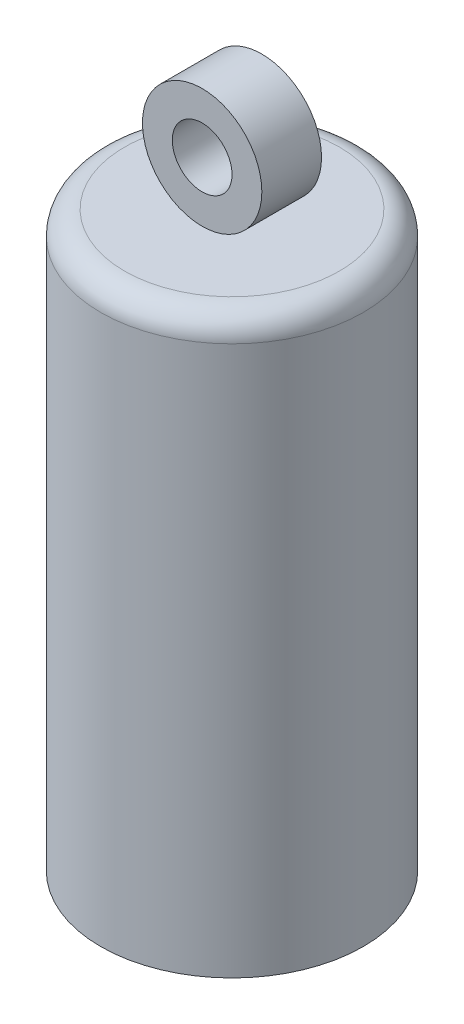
from build123d import *

# Parameters (mm, degrees)
SKETCH1_R           = 5.5
BOSS_EXTRUDE1_DEPTH = 1.5
SKETCH2_R           = 2.5
SKETCH2_R_2         = 1.25
BOSS_EXTRUDE2_DEPTH = 1.25
FILLET1_R           = 1
BOSS_EXTRUDE3_START = 22.5
SKETCH3_R           = 5.5
SKETCH3_R_2         = 5.35
BOSS_EXTRUDE3_DEPTH = 22.5
SKETCH4_R           = 2.75
SKETCH4_R_2         = 2.6
BOSS_EXTRUDE4_DEPTH = 22.5


with BuildPart() as part:
    # Sketch1 → Boss-Extrude1 (new body)
    with BuildSketch(Plane(origin=(0, 0, 0), x_dir=(1, 0, 0), z_dir=(0, 1, 0))):
        with Locations(Location((0, 0, 0), (0, 0, 270))):
            Circle(SKETCH1_R)
    extrude(amount=BOSS_EXTRUDE1_DEPTH)

    # Fillet1
    fillet1_edges = [part.edges().sort_by_distance(p)[0] for p in [
        (0, 1.5, -5.5),
    ]]
    fillet(fillet1_edges, radius=FILLET1_R)

    # Sketch3 → Boss-Extrude3 (add)
    with BuildSketch(Plane.XZ.offset(BOSS_EXTRUDE3_START)):
        with Locations(Location((0, 0, 0), (0, 0, 270))):
            Circle(SKETCH3_R)
        with Locations(Location((0, 0, 0), (0, 0, 90))):
            Circle(SKETCH3_R_2, mode=Mode.SUBTRACT)
    extrude(amount=-BOSS_EXTRUDE3_DEPTH)

    # Sketch4 → Boss-Extrude4 (add)
    with BuildSketch(Plane.XZ):
        with Locations(Location((0, 0, 0), (0, 0, 90))):
            Circle(SKETCH4_R)
        with Locations(Location((0, 0, 0), (0, 0, 90))):
            Circle(SKETCH4_R_2, mode=Mode.SUBTRACT)
    extrude(amount=BOSS_EXTRUDE4_DEPTH)


with BuildPart() as body_2:
    # Sketch2 → Boss-Extrude2 (new, symmetric)
    with BuildSketch(Plane.XY):
        with Locations((0, 4)):
            Circle(SKETCH2_R)
        with Locations((0, 4)):
            Circle(SKETCH2_R_2, mode=Mode.SUBTRACT)
    extrude(amount=BOSS_EXTRUDE2_DEPTH, both=True)


solid = Compound([part.part, body_2.part])
